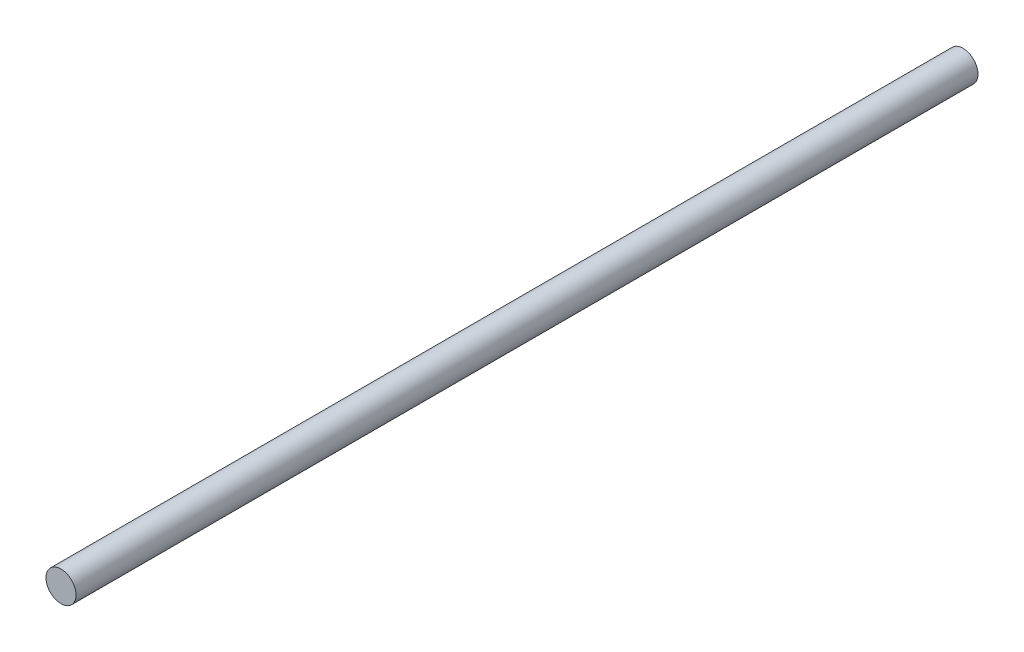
from build123d import *

# Parameters (mm, degrees)
SKETCH1_R           = 30
BOSS_EXTRUDE1_DEPTH = 1800


with BuildPart() as part:
    # Sketch1 → Boss-Extrude1 (new body)
    with BuildSketch(Plane.XY):
        Circle(SKETCH1_R)
    extrude(amount=-BOSS_EXTRUDE1_DEPTH)


solid = part.part
